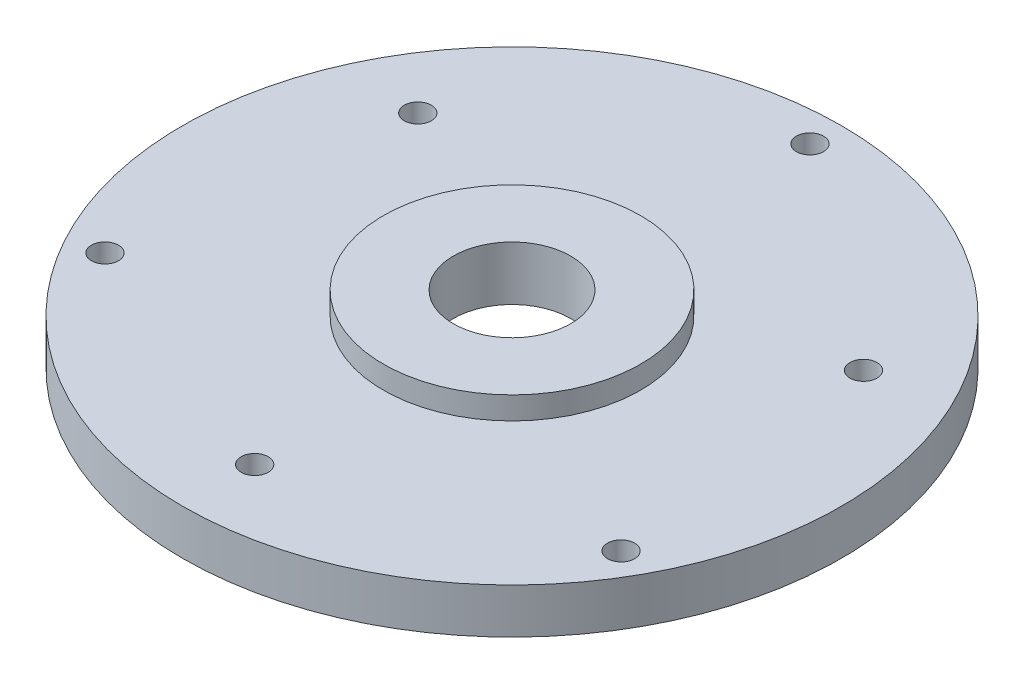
ISO-10303-21;
HEADER;
FILE_DESCRIPTION(('STEP AP214'),'2;1');
FILE_NAME('part.step','',(''),(''),'','','');
FILE_SCHEMA(('AUTOMOTIVE_DESIGN { 1 0 10303 214 1 1 1 1 }'));
ENDSEC;
DATA;
#1=APPLICATION_CONTEXT('core data for automotive mechanical design processes');
#2=APPLICATION_PROTOCOL_DEFINITION('international standard','automotive_design',2000,#1);
#3=PRODUCT_CONTEXT('',#1,'mechanical');
#4=PRODUCT('Part','Part','',(#3));
#5=PRODUCT_RELATED_PRODUCT_CATEGORY('part','',(#4));
#6=PRODUCT_DEFINITION_FORMATION('','',#4);
#7=PRODUCT_DEFINITION_CONTEXT('part definition',#1,'design');
#8=PRODUCT_DEFINITION('design','',#6,#7);
#9=PRODUCT_DEFINITION_SHAPE('','',#8);
#10=(LENGTH_UNIT() NAMED_UNIT(*) SI_UNIT(.MILLI.,.METRE.));
#11=(NAMED_UNIT(*) PLANE_ANGLE_UNIT() SI_UNIT($,.RADIAN.));
#12=(NAMED_UNIT(*) SI_UNIT($,.STERADIAN.) SOLID_ANGLE_UNIT());
#13=UNCERTAINTY_MEASURE_WITH_UNIT(LENGTH_MEASURE(1.E-05),#10,'distance_accuracy_value','');
#14=(GEOMETRIC_REPRESENTATION_CONTEXT(3) GLOBAL_UNCERTAINTY_ASSIGNED_CONTEXT((#13)) GLOBAL_UNIT_ASSIGNED_CONTEXT((#10,
#11,#12)) REPRESENTATION_CONTEXT('',''));
#15=CARTESIAN_POINT('',(0.,0.,0.));
#16=DIRECTION('',(0.,0.,1.));
#17=DIRECTION('',(1.,0.,0.));
#18=AXIS2_PLACEMENT_3D('',#15,#16,#17);
#19=CARTESIAN_POINT('',(0.,0.,0.));
#20=DIRECTION('',(0.,-1.,0.));
#21=DIRECTION('',(0.,0.,-1.));
#22=AXIS2_PLACEMENT_3D('',#19,#20,#21);
#23=CYLINDRICAL_SURFACE('',#22,14.25);
#24=CARTESIAN_POINT('',(0.,41.8859311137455,0.));
#25=DIRECTION('',(0.,-1.,0.));
#26=DIRECTION('',(0.,0.,-1.));
#27=AXIS2_PLACEMENT_3D('',#24,#25,#26);
#28=CIRCLE('',#27,14.25);
#29=CARTESIAN_POINT('',(0.,41.8859311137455,-14.25));
#30=VERTEX_POINT('',#29);
#31=EDGE_CURVE('E10',#30,#30,#28,.T.);
#32=ORIENTED_EDGE('',*,*,#31,.T.);
#33=EDGE_LOOP('',(#32));
#34=FACE_BOUND('',#33,.T.);
#35=CARTESIAN_POINT('',(0.,39.3859311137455,0.));
#36=DIRECTION('',(0.,-1.,0.));
#37=DIRECTION('',(0.,0.,-1.));
#38=AXIS2_PLACEMENT_3D('',#35,#36,#37);
#39=CIRCLE('',#38,14.25);
#40=CARTESIAN_POINT('',(0.,39.3859311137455,-14.25));
#41=VERTEX_POINT('',#40);
#42=EDGE_CURVE('E76',#41,#41,#39,.T.);
#43=ORIENTED_EDGE('',*,*,#42,.F.);
#44=EDGE_LOOP('',(#43));
#45=FACE_BOUND('',#44,.T.);
#46=ADVANCED_FACE('F39',(#34,#45),#23,.T.);
#47=CARTESIAN_POINT('',(6.5,41.8859311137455,0.));
#48=DIRECTION('',(0.,1.,0.));
#49=DIRECTION('',(0.,0.,1.));
#50=AXIS2_PLACEMENT_3D('',#47,#48,#49);
#51=PLANE('',#50);
#52=CARTESIAN_POINT('',(0.,41.8859311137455,0.));
#53=DIRECTION('',(0.,-1.,0.));
#54=DIRECTION('',(0.,0.,-1.));
#55=AXIS2_PLACEMENT_3D('',#52,#53,#54);
#56=CIRCLE('',#55,6.5);
#57=CARTESIAN_POINT('',(0.,41.8859311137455,-6.5));
#58=VERTEX_POINT('',#57);
#59=EDGE_CURVE('E46',#58,#58,#56,.T.);
#60=ORIENTED_EDGE('',*,*,#59,.T.);
#61=EDGE_LOOP('',(#60));
#62=FACE_BOUND('',#61,.T.);
#63=ORIENTED_EDGE('',*,*,#31,.F.);
#64=EDGE_LOOP('',(#63));
#65=FACE_BOUND('',#64,.T.);
#66=ADVANCED_FACE('F109',(#62,#65),#51,.T.);
#67=CARTESIAN_POINT('',(0.,0.,0.));
#68=DIRECTION('',(0.,-1.,0.));
#69=DIRECTION('',(0.,0.,-1.));
#70=AXIS2_PLACEMENT_3D('',#67,#68,#69);
#71=CYLINDRICAL_SURFACE('',#70,6.5);
#72=CARTESIAN_POINT('',(0.,35.8859311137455,0.));
#73=DIRECTION('',(0.,-1.,0.));
#74=DIRECTION('',(0.,0.,-1.));
#75=AXIS2_PLACEMENT_3D('',#72,#73,#74);
#76=CIRCLE('',#75,6.5);
#77=CARTESIAN_POINT('',(0.,35.8859311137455,-6.5));
#78=VERTEX_POINT('',#77);
#79=EDGE_CURVE('E51',#78,#78,#76,.T.);
#80=ORIENTED_EDGE('',*,*,#79,.T.);
#81=EDGE_LOOP('',(#80));
#82=FACE_BOUND('',#81,.T.);
#83=ORIENTED_EDGE('',*,*,#59,.F.);
#84=EDGE_LOOP('',(#83));
#85=FACE_BOUND('',#84,.T.);
#86=ADVANCED_FACE('F94',(#82,#85),#71,.F.);
#87=CARTESIAN_POINT('',(13.,35.8859311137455,0.));
#88=DIRECTION('',(0.,-1.,0.));
#89=DIRECTION('',(0.,0.,-1.));
#90=AXIS2_PLACEMENT_3D('',#87,#88,#89);
#91=PLANE('',#90);
#92=CARTESIAN_POINT('',(0.,35.8859311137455,0.));
#93=DIRECTION('',(0.,-1.,0.));
#94=DIRECTION('',(0.,0.,-1.));
#95=AXIS2_PLACEMENT_3D('',#92,#93,#94);
#96=CIRCLE('',#95,13.);
#97=CARTESIAN_POINT('',(0.,35.8859311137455,-13.));
#98=VERTEX_POINT('',#97);
#99=EDGE_CURVE('E89',#98,#98,#96,.T.);
#100=ORIENTED_EDGE('',*,*,#99,.T.);
#101=EDGE_LOOP('',(#100));
#102=FACE_BOUND('',#101,.T.);
#103=ORIENTED_EDGE('',*,*,#79,.F.);
#104=EDGE_LOOP('',(#103));
#105=FACE_BOUND('',#104,.T.);
#106=ADVANCED_FACE('F97',(#102,#105),#91,.T.);
#107=CARTESIAN_POINT('',(0.,0.,0.));
#108=DIRECTION('',(0.,-1.,0.));
#109=DIRECTION('',(0.,0.,-1.));
#110=AXIS2_PLACEMENT_3D('',#107,#108,#109);
#111=CYLINDRICAL_SURFACE('',#110,13.);
#112=CARTESIAN_POINT('',(0.,34.3859311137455,0.));
#113=DIRECTION('',(0.,-1.,0.));
#114=DIRECTION('',(0.,0.,-1.));
#115=AXIS2_PLACEMENT_3D('',#112,#113,#114);
#116=CIRCLE('',#115,13.);
#117=CARTESIAN_POINT('',(0.,34.3859311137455,-13.));
#118=VERTEX_POINT('',#117);
#119=EDGE_CURVE('E86',#118,#118,#116,.T.);
#120=ORIENTED_EDGE('',*,*,#119,.T.);
#121=EDGE_LOOP('',(#120));
#122=FACE_BOUND('',#121,.T.);
#123=ORIENTED_EDGE('',*,*,#99,.F.);
#124=EDGE_LOOP('',(#123));
#125=FACE_BOUND('',#124,.T.);
#126=ADVANCED_FACE('F99',(#122,#125),#111,.F.);
#127=CARTESIAN_POINT('',(13.,34.3859311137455,0.));
#128=DIRECTION('',(0.,-1.,0.));
#129=DIRECTION('',(0.,0.,-1.));
#130=AXIS2_PLACEMENT_3D('',#127,#128,#129);
#131=PLANE('',#130);
#132=CARTESIAN_POINT('',(0.,34.3859311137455,28.5));
#133=DIRECTION('',(0.,-1.,0.));
#134=DIRECTION('',(0.,0.,-1.));
#135=AXIS2_PLACEMENT_3D('',#132,#133,#134);
#136=CIRCLE('',#135,1.5);
#137=CARTESIAN_POINT('',(0.,34.3859311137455,27.));
#138=VERTEX_POINT('',#137);
#139=EDGE_CURVE('E58',#138,#138,#136,.T.);
#140=ORIENTED_EDGE('',*,*,#139,.F.);
#141=EDGE_LOOP('',(#140));
#142=FACE_BOUND('',#141,.T.);
#143=CARTESIAN_POINT('',(24.6817240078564,34.3859311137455,-14.2500000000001));
#144=DIRECTION('',(0.,-1.,0.));
#145=DIRECTION('',(0.,0.,-1.));
#146=AXIS2_PLACEMENT_3D('',#143,#144,#145);
#147=CIRCLE('',#146,1.5);
#148=CARTESIAN_POINT('',(24.6817240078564,34.3859311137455,-15.7500000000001));
#149=VERTEX_POINT('',#148);
#150=EDGE_CURVE('E169',#149,#149,#147,.T.);
#151=ORIENTED_EDGE('',*,*,#150,.F.);
#152=EDGE_LOOP('',(#151));
#153=FACE_BOUND('',#152,.T.);
#154=CARTESIAN_POINT('',(-24.6817240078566,34.3859311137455,-14.2499999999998));
#155=DIRECTION('',(0.,-1.,0.));
#156=DIRECTION('',(0.,0.,-1.));
#157=AXIS2_PLACEMENT_3D('',#154,#155,#156);
#158=CIRCLE('',#157,1.5);
#159=CARTESIAN_POINT('',(-24.6817240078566,34.3859311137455,-15.7499999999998));
#160=VERTEX_POINT('',#159);
#161=EDGE_CURVE('E172',#160,#160,#158,.T.);
#162=ORIENTED_EDGE('',*,*,#161,.F.);
#163=EDGE_LOOP('',(#162));
#164=FACE_BOUND('',#163,.T.);
#165=CARTESIAN_POINT('',(0.,34.3859311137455,-33.));
#166=DIRECTION('',(0.,1.,0.));
#167=DIRECTION('',(0.,0.,1.));
#168=AXIS2_PLACEMENT_3D('',#165,#166,#167);
#169=CIRCLE('',#168,1.5);
#170=CARTESIAN_POINT('',(0.,34.3859311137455,-31.5));
#171=VERTEX_POINT('',#170);
#172=EDGE_CURVE('E80',#171,#171,#169,.T.);
#173=ORIENTED_EDGE('',*,*,#172,.T.);
#174=EDGE_LOOP('',(#173));
#175=FACE_BOUND('',#174,.T.);
#176=CARTESIAN_POINT('',(28.5788383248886,34.3859311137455,16.4999999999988));
#177=DIRECTION('',(0.,1.,0.));
#178=DIRECTION('',(0.,0.,1.));
#179=AXIS2_PLACEMENT_3D('',#176,#177,#178);
#180=CIRCLE('',#179,1.5000000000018);
#181=CARTESIAN_POINT('',(28.5788383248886,34.3859311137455,18.0000000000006));
#182=VERTEX_POINT('',#181);
#183=EDGE_CURVE('E182',#182,#182,#180,.T.);
#184=ORIENTED_EDGE('',*,*,#183,.T.);
#185=EDGE_LOOP('',(#184));
#186=FACE_BOUND('',#185,.T.);
#187=CARTESIAN_POINT('',(-28.5788383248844,34.3859311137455,16.5000000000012));
#188=DIRECTION('',(0.,1.,0.));
#189=DIRECTION('',(0.,0.,1.));
#190=AXIS2_PLACEMENT_3D('',#187,#188,#189);
#191=CIRCLE('',#190,1.50000000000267);
#192=CARTESIAN_POINT('',(-28.5788383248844,34.3859311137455,18.0000000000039));
#193=VERTEX_POINT('',#192);
#194=EDGE_CURVE('E67',#193,#193,#191,.T.);
#195=ORIENTED_EDGE('',*,*,#194,.T.);
#196=EDGE_LOOP('',(#195));
#197=FACE_BOUND('',#196,.T.);
#198=CARTESIAN_POINT('',(0.,34.3859311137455,0.));
#199=DIRECTION('',(0.,-1.,0.));
#200=DIRECTION('',(0.,0.,-1.));
#201=AXIS2_PLACEMENT_3D('',#198,#199,#200);
#202=CIRCLE('',#201,36.5);
#203=CARTESIAN_POINT('',(0.,34.3859311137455,-36.5));
#204=VERTEX_POINT('',#203);
#205=EDGE_CURVE('E83',#204,#204,#202,.T.);
#206=ORIENTED_EDGE('',*,*,#205,.T.);
#207=EDGE_LOOP('',(#206));
#208=FACE_BOUND('',#207,.T.);
#209=ORIENTED_EDGE('',*,*,#119,.F.);
#210=EDGE_LOOP('',(#209));
#211=FACE_BOUND('',#210,.T.);
#212=ADVANCED_FACE('F106',(#142,#153,#164,#175,#186,#197,#208,#211),#131,.T.);
#213=CARTESIAN_POINT('',(0.,0.,0.));
#214=DIRECTION('',(0.,-1.,0.));
#215=DIRECTION('',(0.,0.,-1.));
#216=AXIS2_PLACEMENT_3D('',#213,#214,#215);
#217=CYLINDRICAL_SURFACE('',#216,36.5);
#218=CARTESIAN_POINT('',(0.,39.3859311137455,0.));
#219=DIRECTION('',(0.,-1.,0.));
#220=DIRECTION('',(0.,0.,-1.));
#221=AXIS2_PLACEMENT_3D('',#218,#219,#220);
#222=CIRCLE('',#221,36.5);
#223=CARTESIAN_POINT('',(0.,39.3859311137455,-36.5));
#224=VERTEX_POINT('',#223);
#225=EDGE_CURVE('E79',#224,#224,#222,.T.);
#226=ORIENTED_EDGE('',*,*,#225,.T.);
#227=EDGE_LOOP('',(#226));
#228=FACE_BOUND('',#227,.T.);
#229=ORIENTED_EDGE('',*,*,#205,.F.);
#230=EDGE_LOOP('',(#229));
#231=FACE_BOUND('',#230,.T.);
#232=ADVANCED_FACE('F123',(#228,#231),#217,.T.);
#233=CARTESIAN_POINT('',(14.25,39.3859311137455,0.));
#234=DIRECTION('',(0.,1.,0.));
#235=DIRECTION('',(0.,0.,1.));
#236=AXIS2_PLACEMENT_3D('',#233,#234,#235);
#237=PLANE('',#236);
#238=CARTESIAN_POINT('',(0.,39.3859311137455,28.5));
#239=DIRECTION('',(0.,1.,0.));
#240=DIRECTION('',(0.,0.,1.));
#241=AXIS2_PLACEMENT_3D('',#238,#239,#240);
#242=CIRCLE('',#241,1.5);
#243=CARTESIAN_POINT('',(0.,39.3859311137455,30.));
#244=VERTEX_POINT('',#243);
#245=EDGE_CURVE('E42',#244,#244,#242,.T.);
#246=ORIENTED_EDGE('',*,*,#245,.F.);
#247=EDGE_LOOP('',(#246));
#248=FACE_BOUND('',#247,.T.);
#249=CARTESIAN_POINT('',(24.6817240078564,39.3859311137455,-14.2500000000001));
#250=DIRECTION('',(0.,1.,0.));
#251=DIRECTION('',(0.,0.,1.));
#252=AXIS2_PLACEMENT_3D('',#249,#250,#251);
#253=CIRCLE('',#252,1.5);
#254=CARTESIAN_POINT('',(24.6817240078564,39.3859311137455,-12.7500000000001));
#255=VERTEX_POINT('',#254);
#256=EDGE_CURVE('E57',#255,#255,#253,.T.);
#257=ORIENTED_EDGE('',*,*,#256,.F.);
#258=EDGE_LOOP('',(#257));
#259=FACE_BOUND('',#258,.T.);
#260=CARTESIAN_POINT('',(-24.6817240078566,39.3859311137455,-14.2499999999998));
#261=DIRECTION('',(0.,1.,0.));
#262=DIRECTION('',(0.,0.,1.));
#263=AXIS2_PLACEMENT_3D('',#260,#261,#262);
#264=CIRCLE('',#263,1.5);
#265=CARTESIAN_POINT('',(-24.6817240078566,39.3859311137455,-12.7499999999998));
#266=VERTEX_POINT('',#265);
#267=EDGE_CURVE('E55',#266,#266,#264,.T.);
#268=ORIENTED_EDGE('',*,*,#267,.F.);
#269=EDGE_LOOP('',(#268));
#270=FACE_BOUND('',#269,.T.);
#271=CARTESIAN_POINT('',(0.,39.3859311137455,-33.));
#272=DIRECTION('',(0.,1.,0.));
#273=DIRECTION('',(0.,0.,1.));
#274=AXIS2_PLACEMENT_3D('',#271,#272,#273);
#275=CIRCLE('',#274,1.5);
#276=CARTESIAN_POINT('',(0.,39.3859311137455,-31.5));
#277=VERTEX_POINT('',#276);
#278=EDGE_CURVE('E179',#277,#277,#275,.T.);
#279=ORIENTED_EDGE('',*,*,#278,.F.);
#280=EDGE_LOOP('',(#279));
#281=FACE_BOUND('',#280,.T.);
#282=CARTESIAN_POINT('',(28.5788383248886,39.3859311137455,16.4999999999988));
#283=DIRECTION('',(0.,1.,0.));
#284=DIRECTION('',(0.,0.,1.));
#285=AXIS2_PLACEMENT_3D('',#282,#283,#284);
#286=CIRCLE('',#285,1.5000000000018);
#287=CARTESIAN_POINT('',(28.5788383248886,39.3859311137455,18.0000000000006));
#288=VERTEX_POINT('',#287);
#289=EDGE_CURVE('E72',#288,#288,#286,.T.);
#290=ORIENTED_EDGE('',*,*,#289,.F.);
#291=EDGE_LOOP('',(#290));
#292=FACE_BOUND('',#291,.T.);
#293=CARTESIAN_POINT('',(-28.5788383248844,39.3859311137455,16.5000000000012));
#294=DIRECTION('',(0.,1.,0.));
#295=DIRECTION('',(0.,0.,1.));
#296=AXIS2_PLACEMENT_3D('',#293,#294,#295);
#297=CIRCLE('',#296,1.50000000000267);
#298=CARTESIAN_POINT('',(-28.5788383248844,39.3859311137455,18.0000000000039));
#299=VERTEX_POINT('',#298);
#300=EDGE_CURVE('E63',#299,#299,#297,.T.);
#301=ORIENTED_EDGE('',*,*,#300,.F.);
#302=EDGE_LOOP('',(#301));
#303=FACE_BOUND('',#302,.T.);
#304=ORIENTED_EDGE('',*,*,#42,.T.);
#305=EDGE_LOOP('',(#304));
#306=FACE_BOUND('',#305,.T.);
#307=ORIENTED_EDGE('',*,*,#225,.F.);
#308=EDGE_LOOP('',(#307));
#309=FACE_BOUND('',#308,.T.);
#310=ADVANCED_FACE('F119',(#248,#259,#270,#281,#292,#303,#306,#309),#237,.T.);
#311=CARTESIAN_POINT('',(-28.5788383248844,34.3859311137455,16.5000000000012));
#312=DIRECTION('',(0.,1.,0.));
#313=DIRECTION('',(0.,0.,1.));
#314=AXIS2_PLACEMENT_3D('',#311,#312,#313);
#315=CYLINDRICAL_SURFACE('',#314,1.50000000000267);
#316=ORIENTED_EDGE('',*,*,#194,.F.);
#317=EDGE_LOOP('',(#316));
#318=FACE_BOUND('',#317,.T.);
#319=ORIENTED_EDGE('',*,*,#300,.T.);
#320=EDGE_LOOP('',(#319));
#321=FACE_BOUND('',#320,.T.);
#322=ADVANCED_FACE('F122',(#318,#321),#315,.F.);
#323=CARTESIAN_POINT('',(28.5788383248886,34.3859311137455,16.4999999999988));
#324=DIRECTION('',(0.,1.,0.));
#325=DIRECTION('',(0.,0.,1.));
#326=AXIS2_PLACEMENT_3D('',#323,#324,#325);
#327=CYLINDRICAL_SURFACE('',#326,1.5000000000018);
#328=ORIENTED_EDGE('',*,*,#183,.F.);
#329=EDGE_LOOP('',(#328));
#330=FACE_BOUND('',#329,.T.);
#331=ORIENTED_EDGE('',*,*,#289,.T.);
#332=EDGE_LOOP('',(#331));
#333=FACE_BOUND('',#332,.T.);
#334=ADVANCED_FACE('F147',(#330,#333),#327,.F.);
#335=CARTESIAN_POINT('',(0.,34.3859311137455,-33.));
#336=DIRECTION('',(0.,1.,0.));
#337=DIRECTION('',(0.,0.,1.));
#338=AXIS2_PLACEMENT_3D('',#335,#336,#337);
#339=CYLINDRICAL_SURFACE('',#338,1.5);
#340=ORIENTED_EDGE('',*,*,#172,.F.);
#341=EDGE_LOOP('',(#340));
#342=FACE_BOUND('',#341,.T.);
#343=ORIENTED_EDGE('',*,*,#278,.T.);
#344=EDGE_LOOP('',(#343));
#345=FACE_BOUND('',#344,.T.);
#346=ADVANCED_FACE('F151',(#342,#345),#339,.F.);
#347=CARTESIAN_POINT('',(-24.6817240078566,41.8859311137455,-14.2499999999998));
#348=DIRECTION('',(0.,-1.,0.));
#349=DIRECTION('',(0.,0.,-1.));
#350=AXIS2_PLACEMENT_3D('',#347,#348,#349);
#351=CYLINDRICAL_SURFACE('',#350,1.5);
#352=ORIENTED_EDGE('',*,*,#267,.T.);
#353=EDGE_LOOP('',(#352));
#354=FACE_BOUND('',#353,.T.);
#355=ORIENTED_EDGE('',*,*,#161,.T.);
#356=EDGE_LOOP('',(#355));
#357=FACE_BOUND('',#356,.T.);
#358=ADVANCED_FACE('F155',(#354,#357),#351,.F.);
#359=CARTESIAN_POINT('',(24.6817240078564,41.8859311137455,-14.2500000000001));
#360=DIRECTION('',(0.,-1.,0.));
#361=DIRECTION('',(0.,0.,-1.));
#362=AXIS2_PLACEMENT_3D('',#359,#360,#361);
#363=CYLINDRICAL_SURFACE('',#362,1.5);
#364=ORIENTED_EDGE('',*,*,#256,.T.);
#365=EDGE_LOOP('',(#364));
#366=FACE_BOUND('',#365,.T.);
#367=ORIENTED_EDGE('',*,*,#150,.T.);
#368=EDGE_LOOP('',(#367));
#369=FACE_BOUND('',#368,.T.);
#370=ADVANCED_FACE('F159',(#366,#369),#363,.F.);
#371=CARTESIAN_POINT('',(0.,41.8859311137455,28.5));
#372=DIRECTION('',(0.,-1.,0.));
#373=DIRECTION('',(0.,0.,-1.));
#374=AXIS2_PLACEMENT_3D('',#371,#372,#373);
#375=CYLINDRICAL_SURFACE('',#374,1.5);
#376=ORIENTED_EDGE('',*,*,#245,.T.);
#377=EDGE_LOOP('',(#376));
#378=FACE_BOUND('',#377,.T.);
#379=ORIENTED_EDGE('',*,*,#139,.T.);
#380=EDGE_LOOP('',(#379));
#381=FACE_BOUND('',#380,.T.);
#382=ADVANCED_FACE('F163',(#378,#381),#375,.F.);
#383=CLOSED_SHELL('',(#46,#66,#86,#106,#126,#212,#232,#310,#322,#334,#346,#358,#370,#382));
#384=MANIFOLD_SOLID_BREP('B2',#383);
#385=ADVANCED_BREP_SHAPE_REPRESENTATION('',(#18,#384),#14);
#386=SHAPE_DEFINITION_REPRESENTATION(#9,#385);
ENDSEC;
END-ISO-10303-21;
